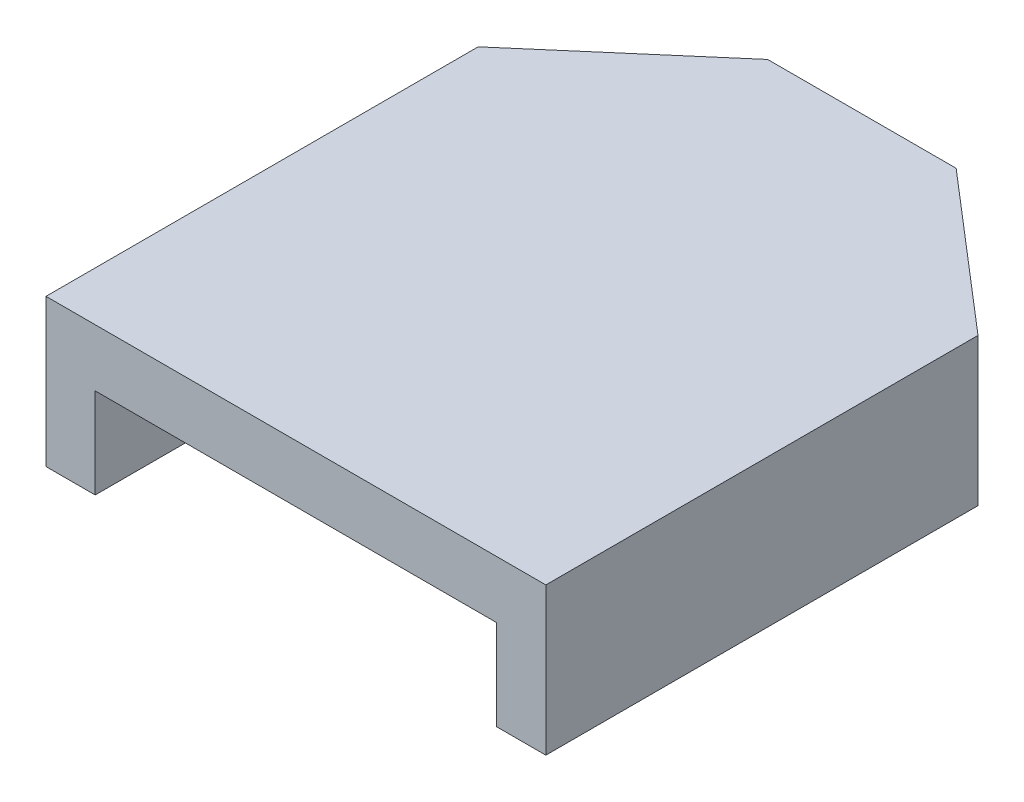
from build123d import *

# Parameters (mm, degrees)
EXTRUDE1_DEPTH = 2.794
SKETCH2_W      = 2.4
SKETCH2_H      = 21.082
EXTRUDE2_DEPTH = 4.4


with BuildPart() as part:
    # Sketch1 → Extrude1 (new body)
    with BuildSketch(Plane(origin=(0, 0, 0), x_dir=(1, 0, 0), z_dir=(0, 1, 0))):
        Polygon((0, 0), (24.384, 0), (24.384, 21.082), (16.7894, 27.6098), (7.5946, 27.6098), (0, 21.082), align=None)
    extrude(amount=EXTRUDE1_DEPTH)

    # Sketch2 → Extrude2 (add)
    with BuildSketch(Plane.XZ):
        with Locations((1.2, -10.541)):
            Rectangle(SKETCH2_W, SKETCH2_H)
        with Locations((23.184, -10.541)):
            Rectangle(SKETCH2_W, SKETCH2_H)
    extrude(amount=EXTRUDE2_DEPTH)


solid = part.part
